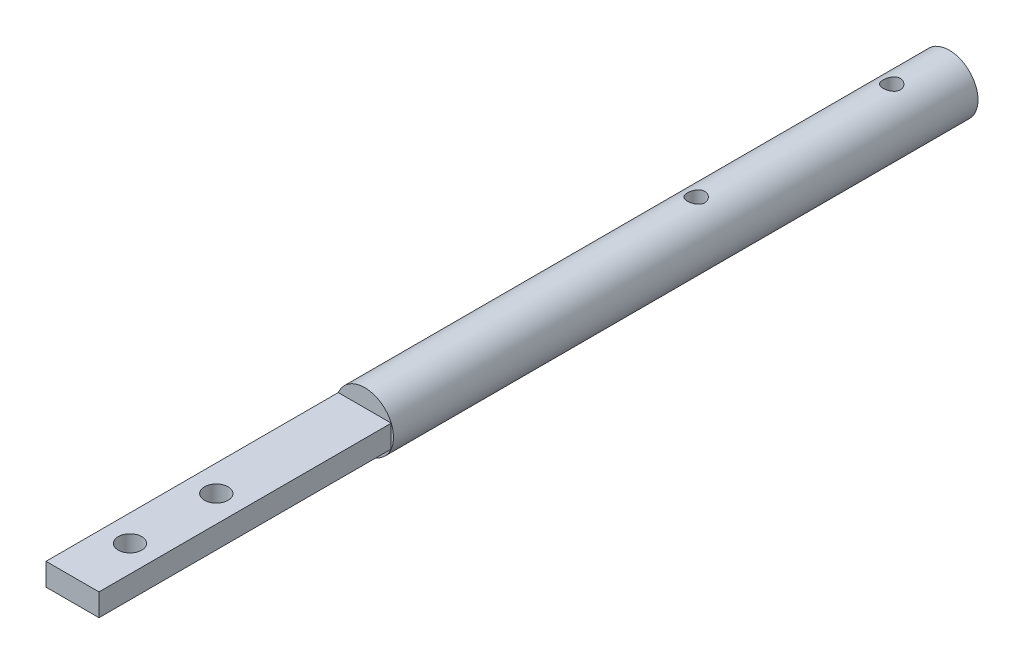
ISO-10303-21;
HEADER;
FILE_DESCRIPTION(('STEP AP214'),'2;1');
FILE_NAME('part.step','',(''),(''),'','','');
FILE_SCHEMA(('AUTOMOTIVE_DESIGN { 1 0 10303 214 1 1 1 1 }'));
ENDSEC;
DATA;
#1=APPLICATION_CONTEXT('core data for automotive mechanical design processes');
#2=APPLICATION_PROTOCOL_DEFINITION('international standard','automotive_design',2000,#1);
#3=PRODUCT_CONTEXT('',#1,'mechanical');
#4=PRODUCT('Part','Part','',(#3));
#5=PRODUCT_RELATED_PRODUCT_CATEGORY('part','',(#4));
#6=PRODUCT_DEFINITION_FORMATION('','',#4);
#7=PRODUCT_DEFINITION_CONTEXT('part definition',#1,'design');
#8=PRODUCT_DEFINITION('design','',#6,#7);
#9=PRODUCT_DEFINITION_SHAPE('','',#8);
#10=(LENGTH_UNIT() NAMED_UNIT(*) SI_UNIT(.MILLI.,.METRE.));
#11=(NAMED_UNIT(*) PLANE_ANGLE_UNIT() SI_UNIT($,.RADIAN.));
#12=(NAMED_UNIT(*) SI_UNIT($,.STERADIAN.) SOLID_ANGLE_UNIT());
#13=UNCERTAINTY_MEASURE_WITH_UNIT(LENGTH_MEASURE(1.E-05),#10,'distance_accuracy_value','');
#14=(GEOMETRIC_REPRESENTATION_CONTEXT(3) GLOBAL_UNCERTAINTY_ASSIGNED_CONTEXT((#13)) GLOBAL_UNIT_ASSIGNED_CONTEXT((#10,
#11,#12)) REPRESENTATION_CONTEXT('',''));
#15=CARTESIAN_POINT('',(0.,0.,0.));
#16=DIRECTION('',(0.,0.,1.));
#17=DIRECTION('',(1.,0.,0.));
#18=AXIS2_PLACEMENT_3D('',#15,#16,#17);
#19=CARTESIAN_POINT('',(0.,0.,50.8));
#20=DIRECTION('',(0.,0.,1.));
#21=DIRECTION('',(1.,0.,0.));
#22=AXIS2_PLACEMENT_3D('',#19,#20,#21);
#23=PLANE('',#22);
#24=DIRECTION('',(0.,-1.,0.));
#25=VECTOR('',#24,1.);
#26=CARTESIAN_POINT('',(-2.30241812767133,-0.974099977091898,50.8));
#27=LINE('',#26,#25);
#28=CARTESIAN_POINT('',(-2.30241812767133,0.974099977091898,50.8));
#29=VERTEX_POINT('',#28);
#30=CARTESIAN_POINT('',(-2.30241812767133,-0.974099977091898,50.8));
#31=VERTEX_POINT('',#30);
#32=EDGE_CURVE('E58',#29,#31,#27,.T.);
#33=ORIENTED_EDGE('',*,*,#32,.F.);
#34=CARTESIAN_POINT('',(0.,0.,50.8));
#35=DIRECTION('',(0.,0.,1.));
#36=DIRECTION('',(1.,0.,0.));
#37=AXIS2_PLACEMENT_3D('',#34,#35,#36);
#38=CIRCLE('',#37,2.5);
#39=EDGE_CURVE('E113',#29,#31,#38,.T.);
#40=ORIENTED_EDGE('',*,*,#39,.T.);
#41=EDGE_LOOP('',(#33,#40));
#42=FACE_BOUND('',#41,.T.);
#43=ADVANCED_FACE('F33',(#42),#23,.T.);
#44=DIRECTION('',(-1.,0.,0.));
#45=VECTOR('',#44,1.);
#46=CARTESIAN_POINT('',(2.30241812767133,0.974099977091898,50.8));
#47=LINE('',#46,#45);
#48=CARTESIAN_POINT('',(2.30241812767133,0.974099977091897,50.8));
#49=VERTEX_POINT('',#48);
#50=EDGE_CURVE('E98',#49,#29,#47,.T.);
#51=ORIENTED_EDGE('',*,*,#50,.F.);
#52=EDGE_CURVE('E110',#49,#29,#38,.T.);
#53=ORIENTED_EDGE('',*,*,#52,.T.);
#54=EDGE_LOOP('',(#51,#53));
#55=FACE_BOUND('',#54,.T.);
#56=ADVANCED_FACE('F164',(#55),#23,.T.);
#57=DIRECTION('',(0.,1.,0.));
#58=VECTOR('',#57,1.);
#59=CARTESIAN_POINT('',(2.30241812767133,-0.974099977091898,50.8));
#60=LINE('',#59,#58);
#61=CARTESIAN_POINT('',(2.30241812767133,-0.974099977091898,50.8));
#62=VERTEX_POINT('',#61);
#63=EDGE_CURVE('E178',#62,#49,#60,.T.);
#64=ORIENTED_EDGE('',*,*,#63,.F.);
#65=EDGE_CURVE('E104',#62,#49,#38,.T.);
#66=ORIENTED_EDGE('',*,*,#65,.T.);
#67=EDGE_LOOP('',(#64,#66));
#68=FACE_BOUND('',#67,.T.);
#69=ADVANCED_FACE('F157',(#68),#23,.T.);
#70=CARTESIAN_POINT('',(0.,0.,50.8));
#71=DIRECTION('',(0.,0.,-1.));
#72=DIRECTION('',(-1.,0.,0.));
#73=AXIS2_PLACEMENT_3D('',#70,#71,#72);
#74=CYLINDRICAL_SURFACE('',#73,2.5);
#75=CARTESIAN_POINT('',(0.,-2.5,22.75));
#76=CARTESIAN_POINT('',(0.0411443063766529,-2.49999964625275,22.7499995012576));
#77=CARTESIAN_POINT('',(0.082293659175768,-2.49897457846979,22.746603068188));
#78=CARTESIAN_POINT('',(0.163394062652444,-2.49498552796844,22.733139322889));
#79=CARTESIAN_POINT('',(0.203344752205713,-2.49202096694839,22.7230700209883));
#80=CARTESIAN_POINT('',(0.280866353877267,-2.48447776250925,22.6966269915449));
#81=CARTESIAN_POINT('',(0.318440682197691,-2.47990150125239,22.6802625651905));
#82=CARTESIAN_POINT('',(0.390312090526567,-2.46961054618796,22.6417319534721));
#83=CARTESIAN_POINT('',(0.424608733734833,-2.46389570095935,22.6195649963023));
#84=CARTESIAN_POINT('',(0.489935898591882,-2.45175368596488,22.5693879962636));
#85=CARTESIAN_POINT('',(0.520859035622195,-2.445311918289,22.5412416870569));
#86=CARTESIAN_POINT('',(0.577624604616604,-2.43252917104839,22.4801953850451));
#87=CARTESIAN_POINT('',(0.603466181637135,-2.42618820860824,22.447294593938));
#88=CARTESIAN_POINT('',(0.649900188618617,-2.41417056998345,22.3767646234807));
#89=CARTESIAN_POINT('',(0.670361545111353,-2.4085120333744,22.3390457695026));
#90=CARTESIAN_POINT('',(0.704606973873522,-2.39871810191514,22.2605053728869));
#91=CARTESIAN_POINT('',(0.718392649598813,-2.39458234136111,22.2196845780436));
#92=CARTESIAN_POINT('',(0.738508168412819,-2.38845435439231,22.1373048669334));
#93=CARTESIAN_POINT('',(0.745035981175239,-2.38640534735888,22.0957986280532));
#94=CARTESIAN_POINT('',(0.7510686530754,-2.38451394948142,22.0122334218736));
#95=CARTESIAN_POINT('',(0.750575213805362,-2.38467102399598,21.9701745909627));
#96=CARTESIAN_POINT('',(0.742734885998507,-2.38712372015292,21.8883080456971));
#97=CARTESIAN_POINT('',(0.735636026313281,-2.38934194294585,21.8484738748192));
#98=CARTESIAN_POINT('',(0.715187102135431,-2.39554178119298,21.7705901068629));
#99=CARTESIAN_POINT('',(0.701836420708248,-2.3995235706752,21.7325406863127));
#100=CARTESIAN_POINT('',(0.66908013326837,-2.40886366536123,21.6586998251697));
#101=CARTESIAN_POINT('',(0.649594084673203,-2.4142400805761,21.6229464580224));
#102=CARTESIAN_POINT('',(0.605176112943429,-2.42575493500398,21.5551339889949));
#103=CARTESIAN_POINT('',(0.580242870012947,-2.43189355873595,21.5230757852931));
#104=CARTESIAN_POINT('',(0.524406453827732,-2.44455505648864,21.462156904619));
#105=CARTESIAN_POINT('',(0.493297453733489,-2.45108327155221,21.4334856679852));
#106=CARTESIAN_POINT('',(0.426631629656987,-2.46356122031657,21.3817230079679));
#107=CARTESIAN_POINT('',(0.391074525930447,-2.46951091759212,21.3586319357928));
#108=CARTESIAN_POINT('',(0.316177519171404,-2.48021580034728,21.3185700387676));
#109=CARTESIAN_POINT('',(0.276813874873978,-2.48496271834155,21.3016412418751));
#110=CARTESIAN_POINT('',(0.195622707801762,-2.49266760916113,21.2747002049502));
#111=CARTESIAN_POINT('',(0.153795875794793,-2.495626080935,21.2646860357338));
#112=CARTESIAN_POINT('',(0.0704761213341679,-2.49934182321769,21.2521739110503));
#113=CARTESIAN_POINT('',(0.0290250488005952,-2.50017425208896,21.2494192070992));
#114=CARTESIAN_POINT('',(-0.0537498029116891,-2.49976461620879,21.250784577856));
#115=CARTESIAN_POINT('',(-0.095073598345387,-2.49852282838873,21.2549037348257));
#116=CARTESIAN_POINT('',(-0.175451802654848,-2.49415348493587,21.2696923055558));
#117=CARTESIAN_POINT('',(-0.214536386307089,-2.49106914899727,21.2802116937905));
#118=CARTESIAN_POINT('',(-0.290377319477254,-2.48337173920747,21.3073216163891));
#119=CARTESIAN_POINT('',(-0.32713338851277,-2.47875848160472,21.3239128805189));
#120=CARTESIAN_POINT('',(-0.398218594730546,-2.46834827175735,21.3631265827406));
#121=CARTESIAN_POINT('',(-0.432471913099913,-2.4625264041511,21.3858796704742));
#122=CARTESIAN_POINT('',(-0.496761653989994,-2.45036734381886,21.4366123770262));
#123=CARTESIAN_POINT('',(-0.526797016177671,-2.44403002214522,21.4645933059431));
#124=CARTESIAN_POINT('',(-0.58292872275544,-2.43126585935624,21.5261936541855));
#125=CARTESIAN_POINT('',(-0.608842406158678,-2.42484412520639,21.5599809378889));
#126=CARTESIAN_POINT('',(-0.654644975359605,-2.41288257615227,21.6315639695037));
#127=CARTESIAN_POINT('',(-0.674534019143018,-2.40734273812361,21.6693596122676));
#128=CARTESIAN_POINT('',(-0.707586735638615,-2.39783594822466,21.7477662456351));
#129=CARTESIAN_POINT('',(-0.72078173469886,-2.39386168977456,21.7883630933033));
#130=CARTESIAN_POINT('',(-0.740108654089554,-2.38795797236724,21.8713439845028));
#131=CARTESIAN_POINT('',(-0.74624299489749,-2.38602781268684,21.9137274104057));
#132=CARTESIAN_POINT('',(-0.751109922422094,-2.38449986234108,21.997180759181));
#133=CARTESIAN_POINT('',(-0.750140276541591,-2.38480823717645,22.0382318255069));
#134=CARTESIAN_POINT('',(-0.741537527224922,-2.38749700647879,22.1195570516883));
#135=CARTESIAN_POINT('',(-0.733904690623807,-2.3898773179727,22.1598312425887));
#136=CARTESIAN_POINT('',(-0.712384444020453,-2.39637881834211,22.2379726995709));
#137=CARTESIAN_POINT('',(-0.69857587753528,-2.40047802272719,22.2758636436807));
#138=CARTESIAN_POINT('',(-0.665157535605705,-2.40995139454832,22.348821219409));
#139=CARTESIAN_POINT('',(-0.645546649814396,-2.41532580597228,22.3838873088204));
#140=CARTESIAN_POINT('',(-0.600243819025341,-2.42698838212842,22.4515815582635));
#141=CARTESIAN_POINT('',(-0.574356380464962,-2.43330270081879,22.4840743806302));
#142=CARTESIAN_POINT('',(-0.51758717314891,-2.44600660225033,22.5443512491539));
#143=CARTESIAN_POINT('',(-0.486704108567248,-2.45239620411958,22.5721340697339));
#144=CARTESIAN_POINT('',(-0.419732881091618,-2.46475468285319,22.6230117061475));
#145=CARTESIAN_POINT('',(-0.383518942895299,-2.47070579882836,22.6459457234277));
#146=CARTESIAN_POINT('',(-0.307570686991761,-2.48130340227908,22.685367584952));
#147=CARTESIAN_POINT('',(-0.267838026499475,-2.48595049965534,22.7018584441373));
#148=CARTESIAN_POINT('',(-0.190378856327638,-2.4930108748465,22.7264476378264));
#149=CARTESIAN_POINT('',(-0.152893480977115,-2.49561013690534,22.7352558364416));
#150=CARTESIAN_POINT('',(-0.0769400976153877,-2.49910472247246,22.7470317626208));
#151=CARTESIAN_POINT('',(-0.0384722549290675,-2.5000003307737,22.7500004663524));
#152=CARTESIAN_POINT('',(0.,-2.5,22.75));
#153=B_SPLINE_CURVE_WITH_KNOTS('',3,(#75,#76,#77,#78,#79,#80,#81,#82,#83,#84,#85,#86,#87,#88,
#89,#90,#91,#92,#93,#94,#95,#96,#97,#98,#99,#100,#101,#102,#103,#104,#105,#106,#107,#108,#109,
#110,#111,#112,#113,#114,#115,#116,#117,#118,#119,#120,#121,#122,#123,#124,#125,#126,#127,#128,
#129,#130,#131,#132,#133,#134,#135,#136,#137,#138,#139,#140,#141,#142,#143,#144,#145,#146,#147,
#148,#149,#150,#151,#152),.UNSPECIFIED.,.T.,.F.,(4,2,2,2,2,2,2,2,2,2,2,2,2,2,2,2,2,2,2,2,2,2,2,
2,2,2,2,2,2,2,2,2,2,2,2,2,2,2,4),(0.,0.123291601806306,0.246619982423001,0.369766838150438,
0.492930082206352,0.619278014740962,0.745647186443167,0.874857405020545,1.00403657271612,
1.12959844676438,1.25512989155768,1.37613008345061,1.49714221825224,1.61981213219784,
1.74251180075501,1.87033552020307,1.99816728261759,2.12685523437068,2.25550726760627,
2.37954404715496,2.50356426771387,2.62478373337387,2.74601777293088,2.87005652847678,
2.99412640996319,3.12270200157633,3.25127422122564,3.37923907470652,3.50716004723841,
3.62975077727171,3.752336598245,3.8734002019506,3.99448698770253,4.11998462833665,
4.24551487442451,4.37471498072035,4.50385455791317,4.61915845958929,4.73444308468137),.UNSPECIFIED.);
#154=CARTESIAN_POINT('',(0.,-2.5,22.75));
#155=VERTEX_POINT('',#154);
#156=EDGE_CURVE('E11',#155,#155,#153,.T.);
#157=ORIENTED_EDGE('',*,*,#156,.T.);
#158=EDGE_LOOP('',(#157));
#159=FACE_BOUND('',#158,.T.);
#160=CARTESIAN_POINT('',(0.,2.5,22.75));
#161=CARTESIAN_POINT('',(-0.0411443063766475,2.49999964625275,22.7499995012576));
#162=CARTESIAN_POINT('',(-0.0822936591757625,2.49897457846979,22.746603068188));
#163=CARTESIAN_POINT('',(-0.163394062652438,2.49498552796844,22.733139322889));
#164=CARTESIAN_POINT('',(-0.203344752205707,2.49202096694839,22.7230700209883));
#165=CARTESIAN_POINT('',(-0.280866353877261,2.48447776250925,22.6966269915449));
#166=CARTESIAN_POINT('',(-0.318440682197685,2.47990150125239,22.6802625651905));
#167=CARTESIAN_POINT('',(-0.390312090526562,2.46961054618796,22.6417319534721));
#168=CARTESIAN_POINT('',(-0.424608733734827,2.46389570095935,22.6195649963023));
#169=CARTESIAN_POINT('',(-0.489935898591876,2.45175368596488,22.5693879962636));
#170=CARTESIAN_POINT('',(-0.520859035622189,2.445311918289,22.5412416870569));
#171=CARTESIAN_POINT('',(-0.577624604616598,2.43252917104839,22.4801953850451));
#172=CARTESIAN_POINT('',(-0.60346618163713,2.42618820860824,22.447294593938));
#173=CARTESIAN_POINT('',(-0.649900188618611,2.41417056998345,22.3767646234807));
#174=CARTESIAN_POINT('',(-0.670361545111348,2.4085120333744,22.3390457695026));
#175=CARTESIAN_POINT('',(-0.704606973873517,2.39871810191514,22.2605053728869));
#176=CARTESIAN_POINT('',(-0.718392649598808,2.39458234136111,22.2196845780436));
#177=CARTESIAN_POINT('',(-0.738508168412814,2.38845435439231,22.1373048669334));
#178=CARTESIAN_POINT('',(-0.745035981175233,2.38640534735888,22.0957986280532));
#179=CARTESIAN_POINT('',(-0.751068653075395,2.38451394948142,22.0122334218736));
#180=CARTESIAN_POINT('',(-0.750575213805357,2.38467102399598,21.9701745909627));
#181=CARTESIAN_POINT('',(-0.742734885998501,2.38712372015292,21.8883080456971));
#182=CARTESIAN_POINT('',(-0.735636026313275,2.38934194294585,21.8484738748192));
#183=CARTESIAN_POINT('',(-0.715187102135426,2.39554178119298,21.7705901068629));
#184=CARTESIAN_POINT('',(-0.701836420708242,2.3995235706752,21.7325406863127));
#185=CARTESIAN_POINT('',(-0.669080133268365,2.40886366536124,21.6586998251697));
#186=CARTESIAN_POINT('',(-0.649594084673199,2.4142400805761,21.6229464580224));
#187=CARTESIAN_POINT('',(-0.605176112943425,2.42575493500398,21.5551339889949));
#188=CARTESIAN_POINT('',(-0.580242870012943,2.43189355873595,21.5230757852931));
#189=CARTESIAN_POINT('',(-0.524406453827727,2.44455505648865,21.462156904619));
#190=CARTESIAN_POINT('',(-0.493297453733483,2.45108327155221,21.4334856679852));
#191=CARTESIAN_POINT('',(-0.426631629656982,2.46356122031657,21.3817230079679));
#192=CARTESIAN_POINT('',(-0.391074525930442,2.46951091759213,21.3586319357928));
#193=CARTESIAN_POINT('',(-0.316177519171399,2.48021580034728,21.3185700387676));
#194=CARTESIAN_POINT('',(-0.276813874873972,2.48496271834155,21.3016412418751));
#195=CARTESIAN_POINT('',(-0.195622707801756,2.49266760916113,21.2747002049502));
#196=CARTESIAN_POINT('',(-0.153795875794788,2.495626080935,21.2646860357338));
#197=CARTESIAN_POINT('',(-0.0704761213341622,2.49934182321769,21.2521739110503));
#198=CARTESIAN_POINT('',(-0.0290250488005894,2.50017425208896,21.2494192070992));
#199=CARTESIAN_POINT('',(0.0537498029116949,2.49976461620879,21.250784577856));
#200=CARTESIAN_POINT('',(0.0950735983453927,2.49852282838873,21.2549037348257));
#201=CARTESIAN_POINT('',(0.175451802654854,2.49415348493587,21.2696923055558));
#202=CARTESIAN_POINT('',(0.214536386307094,2.49106914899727,21.2802116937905));
#203=CARTESIAN_POINT('',(0.290377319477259,2.48337173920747,21.3073216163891));
#204=CARTESIAN_POINT('',(0.327133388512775,2.47875848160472,21.3239128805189));
#205=CARTESIAN_POINT('',(0.398218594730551,2.46834827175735,21.3631265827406));
#206=CARTESIAN_POINT('',(0.432471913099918,2.4625264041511,21.3858796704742));
#207=CARTESIAN_POINT('',(0.496761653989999,2.45036734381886,21.4366123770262));
#208=CARTESIAN_POINT('',(0.526797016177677,2.44403002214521,21.4645933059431));
#209=CARTESIAN_POINT('',(0.582928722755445,2.43126585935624,21.5261936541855));
#210=CARTESIAN_POINT('',(0.608842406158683,2.42484412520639,21.5599809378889));
#211=CARTESIAN_POINT('',(0.65464497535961,2.41288257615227,21.6315639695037));
#212=CARTESIAN_POINT('',(0.674534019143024,2.40734273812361,21.6693596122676));
#213=CARTESIAN_POINT('',(0.70758673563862,2.39783594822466,21.7477662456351));
#214=CARTESIAN_POINT('',(0.720781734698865,2.39386168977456,21.7883630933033));
#215=CARTESIAN_POINT('',(0.740108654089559,2.38795797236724,21.8713439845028));
#216=CARTESIAN_POINT('',(0.746242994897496,2.38602781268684,21.9137274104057));
#217=CARTESIAN_POINT('',(0.751109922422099,2.38449986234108,21.997180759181));
#218=CARTESIAN_POINT('',(0.750140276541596,2.38480823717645,22.0382318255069));
#219=CARTESIAN_POINT('',(0.741537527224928,2.38749700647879,22.1195570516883));
#220=CARTESIAN_POINT('',(0.733904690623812,2.3898773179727,22.1598312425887));
#221=CARTESIAN_POINT('',(0.712384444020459,2.39637881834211,22.2379726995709));
#222=CARTESIAN_POINT('',(0.698575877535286,2.40047802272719,22.2758636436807));
#223=CARTESIAN_POINT('',(0.665157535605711,2.40995139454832,22.348821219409));
#224=CARTESIAN_POINT('',(0.645546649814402,2.41532580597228,22.3838873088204));
#225=CARTESIAN_POINT('',(0.600243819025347,2.42698838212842,22.4515815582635));
#226=CARTESIAN_POINT('',(0.574356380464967,2.43330270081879,22.4840743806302));
#227=CARTESIAN_POINT('',(0.517587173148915,2.44600660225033,22.5443512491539));
#228=CARTESIAN_POINT('',(0.486704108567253,2.45239620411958,22.5721340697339));
#229=CARTESIAN_POINT('',(0.419732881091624,2.46475468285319,22.6230117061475));
#230=CARTESIAN_POINT('',(0.383518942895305,2.47070579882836,22.6459457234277));
#231=CARTESIAN_POINT('',(0.307570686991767,2.48130340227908,22.685367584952));
#232=CARTESIAN_POINT('',(0.26783802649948,2.48595049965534,22.7018584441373));
#233=CARTESIAN_POINT('',(0.190378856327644,2.4930108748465,22.7264476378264));
#234=CARTESIAN_POINT('',(0.15289348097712,2.49561013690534,22.7352558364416));
#235=CARTESIAN_POINT('',(0.0769400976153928,2.49910472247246,22.7470317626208));
#236=CARTESIAN_POINT('',(0.0384722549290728,2.5000003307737,22.7500004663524));
#237=CARTESIAN_POINT('',(0.,2.5,22.75));
#238=B_SPLINE_CURVE_WITH_KNOTS('',3,(#160,#161,#162,#163,#164,#165,#166,#167,#168,#169,#170,
#171,#172,#173,#174,#175,#176,#177,#178,#179,#180,#181,#182,#183,#184,#185,#186,#187,#188,#189,
#190,#191,#192,#193,#194,#195,#196,#197,#198,#199,#200,#201,#202,#203,#204,#205,#206,#207,#208,
#209,#210,#211,#212,#213,#214,#215,#216,#217,#218,#219,#220,#221,#222,#223,#224,#225,#226,#227,
#228,#229,#230,#231,#232,#233,#234,#235,#236,#237),.UNSPECIFIED.,.T.,.F.,(4,2,2,2,2,2,2,2,2,2,2,
2,2,2,2,2,2,2,2,2,2,2,2,2,2,2,2,2,2,2,2,2,2,2,2,2,2,2,4),(0.,0.123291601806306,0.246619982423,
0.369766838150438,0.492930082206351,0.619278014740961,0.745647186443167,0.874857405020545,
1.00403657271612,1.12959844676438,1.25512989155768,1.37613008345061,1.49714221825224,
1.61981213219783,1.74251180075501,1.87033552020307,1.99816728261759,2.12685523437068,
2.25550726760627,2.37954404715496,2.50356426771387,2.62478373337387,2.74601777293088,
2.87005652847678,2.99412640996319,3.12270200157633,3.25127422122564,3.37923907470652,
3.50716004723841,3.62975077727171,3.752336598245,3.8734002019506,3.99448698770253,
4.11998462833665,4.24551487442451,4.37471498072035,4.50385455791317,4.61915845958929,
4.73444308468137),.UNSPECIFIED.);
#239=CARTESIAN_POINT('',(0.,2.5,22.75));
#240=VERTEX_POINT('',#239);
#241=EDGE_CURVE('E45',#240,#240,#238,.T.);
#242=ORIENTED_EDGE('',*,*,#241,.T.);
#243=EDGE_LOOP('',(#242));
#244=FACE_BOUND('',#243,.T.);
#245=CARTESIAN_POINT('',(0.,-2.5,5.75));
#246=CARTESIAN_POINT('',(0.0411443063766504,-2.49999964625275,5.74999950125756));
#247=CARTESIAN_POINT('',(0.0822936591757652,-2.49897457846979,5.74660306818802));
#248=CARTESIAN_POINT('',(0.163394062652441,-2.49498552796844,5.73313932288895));
#249=CARTESIAN_POINT('',(0.20334475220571,-2.49202096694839,5.72307002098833));
#250=CARTESIAN_POINT('',(0.280866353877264,-2.48447776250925,5.69662699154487));
#251=CARTESIAN_POINT('',(0.318440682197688,-2.47990150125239,5.68026256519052));
#252=CARTESIAN_POINT('',(0.390312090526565,-2.46961054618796,5.64173195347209));
#253=CARTESIAN_POINT('',(0.42460873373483,-2.46389570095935,5.61956499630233));
#254=CARTESIAN_POINT('',(0.489935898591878,-2.45175368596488,5.56938799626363));
#255=CARTESIAN_POINT('',(0.52085903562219,-2.445311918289,5.5412416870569));
#256=CARTESIAN_POINT('',(0.577624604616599,-2.43252917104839,5.48019538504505));
#257=CARTESIAN_POINT('',(0.603466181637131,-2.42618820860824,5.44729459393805));
#258=CARTESIAN_POINT('',(0.649900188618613,-2.41417056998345,5.37676462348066));
#259=CARTESIAN_POINT('',(0.67036154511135,-2.4085120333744,5.33904576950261));
#260=CARTESIAN_POINT('',(0.704606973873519,-2.39871810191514,5.26050537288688));
#261=CARTESIAN_POINT('',(0.71839264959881,-2.39458234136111,5.21968457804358));
#262=CARTESIAN_POINT('',(0.738508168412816,-2.38845435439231,5.13730486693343));
#263=CARTESIAN_POINT('',(0.745035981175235,-2.38640534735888,5.09579862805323));
#264=CARTESIAN_POINT('',(0.751068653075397,-2.38451394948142,5.01223342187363));
#265=CARTESIAN_POINT('',(0.750575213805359,-2.38467102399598,4.97017459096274));
#266=CARTESIAN_POINT('',(0.742734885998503,-2.38712372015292,4.88830804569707));
#267=CARTESIAN_POINT('',(0.735636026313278,-2.38934194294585,4.84847387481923));
#268=CARTESIAN_POINT('',(0.715187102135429,-2.39554178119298,4.77059010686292));
#269=CARTESIAN_POINT('',(0.701836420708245,-2.3995235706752,4.73254068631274));
#270=CARTESIAN_POINT('',(0.669080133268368,-2.40886366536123,4.65869982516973));
#271=CARTESIAN_POINT('',(0.649594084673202,-2.4142400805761,4.6229464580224));
#272=CARTESIAN_POINT('',(0.605176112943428,-2.42575493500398,4.55513398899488));
#273=CARTESIAN_POINT('',(0.580242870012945,-2.43189355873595,4.52307578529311));
#274=CARTESIAN_POINT('',(0.524406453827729,-2.44455505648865,4.462156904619));
#275=CARTESIAN_POINT('',(0.493297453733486,-2.45108327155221,4.43348566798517));
#276=CARTESIAN_POINT('',(0.426631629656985,-2.46356122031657,4.38172300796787));
#277=CARTESIAN_POINT('',(0.391074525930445,-2.46951091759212,4.35863193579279));
#278=CARTESIAN_POINT('',(0.316177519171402,-2.48021580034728,4.31857003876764));
#279=CARTESIAN_POINT('',(0.276813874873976,-2.48496271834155,4.30164124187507));
#280=CARTESIAN_POINT('',(0.195622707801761,-2.49266760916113,4.27470020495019));
#281=CARTESIAN_POINT('',(0.153795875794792,-2.495626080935,4.26468603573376));
#282=CARTESIAN_POINT('',(0.0704761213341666,-2.49934182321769,4.2521739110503));
#283=CARTESIAN_POINT('',(0.029025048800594,-2.50017425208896,4.2494192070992));
#284=CARTESIAN_POINT('',(-0.0537498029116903,-2.49976461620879,4.25078457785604));
#285=CARTESIAN_POINT('',(-0.0950735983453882,-2.49852282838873,4.25490373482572));
#286=CARTESIAN_POINT('',(-0.175451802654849,-2.49415348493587,4.26969230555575));
#287=CARTESIAN_POINT('',(-0.214536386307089,-2.49106914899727,4.28021169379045));
#288=CARTESIAN_POINT('',(-0.290377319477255,-2.48337173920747,4.30732161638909));
#289=CARTESIAN_POINT('',(-0.327133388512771,-2.47875848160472,4.32391288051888));
#290=CARTESIAN_POINT('',(-0.398218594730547,-2.46834827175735,4.36312658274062));
#291=CARTESIAN_POINT('',(-0.432471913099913,-2.4625264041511,4.3858796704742));
#292=CARTESIAN_POINT('',(-0.496761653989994,-2.45036734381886,4.4366123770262));
#293=CARTESIAN_POINT('',(-0.526797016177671,-2.44403002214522,4.46459330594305));
#294=CARTESIAN_POINT('',(-0.58292872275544,-2.43126585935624,4.52619365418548));
#295=CARTESIAN_POINT('',(-0.608842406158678,-2.42484412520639,4.55998093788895));
#296=CARTESIAN_POINT('',(-0.654644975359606,-2.41288257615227,4.63156396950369));
#297=CARTESIAN_POINT('',(-0.67453401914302,-2.40734273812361,4.66935961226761));
#298=CARTESIAN_POINT('',(-0.707586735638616,-2.39783594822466,4.74776624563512));
#299=CARTESIAN_POINT('',(-0.720781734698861,-2.39386168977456,4.7883630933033));
#300=CARTESIAN_POINT('',(-0.740108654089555,-2.38795797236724,4.87134398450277));
#301=CARTESIAN_POINT('',(-0.746242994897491,-2.38602781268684,4.91372741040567));
#302=CARTESIAN_POINT('',(-0.751109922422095,-2.38449986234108,4.99718075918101));
#303=CARTESIAN_POINT('',(-0.750140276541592,-2.38480823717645,5.03823182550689));
#304=CARTESIAN_POINT('',(-0.741537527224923,-2.38749700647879,5.1195570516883));
#305=CARTESIAN_POINT('',(-0.733904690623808,-2.3898773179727,5.15983124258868));
#306=CARTESIAN_POINT('',(-0.712384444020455,-2.39637881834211,5.23797269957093));
#307=CARTESIAN_POINT('',(-0.698575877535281,-2.40047802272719,5.27586364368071));
#308=CARTESIAN_POINT('',(-0.665157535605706,-2.40995139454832,5.348821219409));
#309=CARTESIAN_POINT('',(-0.645546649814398,-2.41532580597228,5.38388730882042));
#310=CARTESIAN_POINT('',(-0.600243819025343,-2.42698838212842,5.45158155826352));
#311=CARTESIAN_POINT('',(-0.574356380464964,-2.43330270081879,5.4840743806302));
#312=CARTESIAN_POINT('',(-0.517587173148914,-2.44600660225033,5.54435124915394));
#313=CARTESIAN_POINT('',(-0.486704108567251,-2.45239620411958,5.57213406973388));
#314=CARTESIAN_POINT('',(-0.419732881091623,-2.46475468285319,5.62301170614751));
#315=CARTESIAN_POINT('',(-0.383518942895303,-2.47070579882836,5.64594572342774));
#316=CARTESIAN_POINT('',(-0.307570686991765,-2.48130340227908,5.68536758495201));
#317=CARTESIAN_POINT('',(-0.267838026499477,-2.48595049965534,5.70185844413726));
#318=CARTESIAN_POINT('',(-0.19037885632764,-2.4930108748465,5.72644763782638));
#319=CARTESIAN_POINT('',(-0.152893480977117,-2.49561013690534,5.73525583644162));
#320=CARTESIAN_POINT('',(-0.0769400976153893,-2.49910472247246,5.74703176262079));
#321=CARTESIAN_POINT('',(-0.0384722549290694,-2.5000003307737,5.75000046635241));
#322=CARTESIAN_POINT('',(0.,-2.5,5.75));
#323=B_SPLINE_CURVE_WITH_KNOTS('',3,(#245,#246,#247,#248,#249,#250,#251,#252,#253,#254,#255,
#256,#257,#258,#259,#260,#261,#262,#263,#264,#265,#266,#267,#268,#269,#270,#271,#272,#273,#274,
#275,#276,#277,#278,#279,#280,#281,#282,#283,#284,#285,#286,#287,#288,#289,#290,#291,#292,#293,
#294,#295,#296,#297,#298,#299,#300,#301,#302,#303,#304,#305,#306,#307,#308,#309,#310,#311,#312,
#313,#314,#315,#316,#317,#318,#319,#320,#321,#322),.UNSPECIFIED.,.T.,.F.,(4,2,2,2,2,2,2,2,2,2,2,
2,2,2,2,2,2,2,2,2,2,2,2,2,2,2,2,2,2,2,2,2,2,2,2,2,2,2,4),(0.,0.123291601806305,0.246619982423,
0.369766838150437,0.492930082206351,0.619278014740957,0.745647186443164,0.874857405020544,
1.00403657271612,1.12959844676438,1.25512989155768,1.37613008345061,1.49714221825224,
1.61981213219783,1.74251180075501,1.87033552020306,1.99816728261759,2.12685523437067,
2.25550726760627,2.37954404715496,2.50356426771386,2.62478373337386,2.74601777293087,
2.87005652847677,2.99412640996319,3.12270200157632,3.25127422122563,3.37923907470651,
3.5071600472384,3.6297507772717,3.75233659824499,3.87340020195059,3.99448698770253,
4.11998462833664,4.2455148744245,4.37471498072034,4.50385455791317,4.61915845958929,
4.73444308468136),.UNSPECIFIED.);
#324=CARTESIAN_POINT('',(0.,-2.5,5.75));
#325=VERTEX_POINT('',#324);
#326=EDGE_CURVE('E120',#325,#325,#323,.T.);
#327=ORIENTED_EDGE('',*,*,#326,.T.);
#328=EDGE_LOOP('',(#327));
#329=FACE_BOUND('',#328,.T.);
#330=CARTESIAN_POINT('',(0.,2.5,5.75));
#331=CARTESIAN_POINT('',(-0.0411443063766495,2.49999964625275,5.74999950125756));
#332=CARTESIAN_POINT('',(-0.0822936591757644,2.49897457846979,5.74660306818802));
#333=CARTESIAN_POINT('',(-0.16339406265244,2.49498552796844,5.73313932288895));
#334=CARTESIAN_POINT('',(-0.203344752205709,2.49202096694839,5.72307002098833));
#335=CARTESIAN_POINT('',(-0.280866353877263,2.48447776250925,5.69662699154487));
#336=CARTESIAN_POINT('',(-0.318440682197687,2.47990150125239,5.68026256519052));
#337=CARTESIAN_POINT('',(-0.390312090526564,2.46961054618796,5.64173195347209));
#338=CARTESIAN_POINT('',(-0.424608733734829,2.46389570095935,5.61956499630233));
#339=CARTESIAN_POINT('',(-0.489935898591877,2.45175368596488,5.56938799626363));
#340=CARTESIAN_POINT('',(-0.520859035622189,2.445311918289,5.5412416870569));
#341=CARTESIAN_POINT('',(-0.577624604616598,2.43252917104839,5.48019538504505));
#342=CARTESIAN_POINT('',(-0.60346618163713,2.42618820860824,5.44729459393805));
#343=CARTESIAN_POINT('',(-0.649900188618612,2.41417056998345,5.37676462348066));
#344=CARTESIAN_POINT('',(-0.670361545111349,2.4085120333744,5.33904576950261));
#345=CARTESIAN_POINT('',(-0.704606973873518,2.39871810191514,5.26050537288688));
#346=CARTESIAN_POINT('',(-0.718392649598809,2.39458234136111,5.21968457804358));
#347=CARTESIAN_POINT('',(-0.738508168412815,2.38845435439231,5.13730486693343));
#348=CARTESIAN_POINT('',(-0.745035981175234,2.38640534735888,5.09579862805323));
#349=CARTESIAN_POINT('',(-0.751068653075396,2.38451394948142,5.01223342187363));
#350=CARTESIAN_POINT('',(-0.750575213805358,2.38467102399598,4.97017459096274));
#351=CARTESIAN_POINT('',(-0.742734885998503,2.38712372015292,4.88830804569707));
#352=CARTESIAN_POINT('',(-0.735636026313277,2.38934194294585,4.84847387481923));
#353=CARTESIAN_POINT('',(-0.715187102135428,2.39554178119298,4.77059010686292));
#354=CARTESIAN_POINT('',(-0.701836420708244,2.3995235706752,4.73254068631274));
#355=CARTESIAN_POINT('',(-0.669080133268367,2.40886366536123,4.65869982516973));
#356=CARTESIAN_POINT('',(-0.649594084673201,2.4142400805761,4.6229464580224));
#357=CARTESIAN_POINT('',(-0.605176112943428,2.42575493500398,4.55513398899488));
#358=CARTESIAN_POINT('',(-0.580242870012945,2.43189355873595,4.52307578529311));
#359=CARTESIAN_POINT('',(-0.524406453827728,2.44455505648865,4.462156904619));
#360=CARTESIAN_POINT('',(-0.493297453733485,2.45108327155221,4.43348566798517));
#361=CARTESIAN_POINT('',(-0.426631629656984,2.46356122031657,4.38172300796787));
#362=CARTESIAN_POINT('',(-0.391074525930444,2.46951091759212,4.35863193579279));
#363=CARTESIAN_POINT('',(-0.316177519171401,2.48021580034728,4.31857003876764));
#364=CARTESIAN_POINT('',(-0.276813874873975,2.48496271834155,4.30164124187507));
#365=CARTESIAN_POINT('',(-0.19562270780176,2.49266760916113,4.27470020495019));
#366=CARTESIAN_POINT('',(-0.153795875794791,2.495626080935,4.26468603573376));
#367=CARTESIAN_POINT('',(-0.0704761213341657,2.49934182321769,4.2521739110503));
#368=CARTESIAN_POINT('',(-0.0290250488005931,2.50017425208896,4.2494192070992));
#369=CARTESIAN_POINT('',(0.0537498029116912,2.49976461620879,4.25078457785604));
#370=CARTESIAN_POINT('',(0.095073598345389,2.49852282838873,4.25490373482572));
#371=CARTESIAN_POINT('',(0.17545180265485,2.49415348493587,4.26969230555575));
#372=CARTESIAN_POINT('',(0.21453638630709,2.49106914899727,4.28021169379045));
#373=CARTESIAN_POINT('',(0.290377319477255,2.48337173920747,4.30732161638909));
#374=CARTESIAN_POINT('',(0.327133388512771,2.47875848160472,4.32391288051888));
#375=CARTESIAN_POINT('',(0.398218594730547,2.46834827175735,4.36312658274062));
#376=CARTESIAN_POINT('',(0.432471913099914,2.4625264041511,4.3858796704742));
#377=CARTESIAN_POINT('',(0.496761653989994,2.45036734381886,4.4366123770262));
#378=CARTESIAN_POINT('',(0.526797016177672,2.44403002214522,4.46459330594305));
#379=CARTESIAN_POINT('',(0.582928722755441,2.43126585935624,4.52619365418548));
#380=CARTESIAN_POINT('',(0.608842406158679,2.42484412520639,4.55998093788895));
#381=CARTESIAN_POINT('',(0.654644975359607,2.41288257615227,4.63156396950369));
#382=CARTESIAN_POINT('',(0.674534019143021,2.40734273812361,4.66935961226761));
#383=CARTESIAN_POINT('',(0.707586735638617,2.39783594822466,4.74776624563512));
#384=CARTESIAN_POINT('',(0.720781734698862,2.39386168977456,4.7883630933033));
#385=CARTESIAN_POINT('',(0.740108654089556,2.38795797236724,4.87134398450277));
#386=CARTESIAN_POINT('',(0.746242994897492,2.38602781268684,4.91372741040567));
#387=CARTESIAN_POINT('',(0.751109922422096,2.38449986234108,4.99718075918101));
#388=CARTESIAN_POINT('',(0.750140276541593,2.38480823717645,5.03823182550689));
#389=CARTESIAN_POINT('',(0.741537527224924,2.38749700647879,5.1195570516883));
#390=CARTESIAN_POINT('',(0.733904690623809,2.3898773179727,5.15983124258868));
#391=CARTESIAN_POINT('',(0.712384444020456,2.39637881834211,5.23797269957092));
#392=CARTESIAN_POINT('',(0.698575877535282,2.40047802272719,5.27586364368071));
#393=CARTESIAN_POINT('',(0.665157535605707,2.40995139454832,5.348821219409));
#394=CARTESIAN_POINT('',(0.645546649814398,2.41532580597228,5.38388730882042));
#395=CARTESIAN_POINT('',(0.600243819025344,2.42698838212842,5.45158155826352));
#396=CARTESIAN_POINT('',(0.574356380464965,2.43330270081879,5.4840743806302));
#397=CARTESIAN_POINT('',(0.517587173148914,2.44600660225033,5.54435124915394));
#398=CARTESIAN_POINT('',(0.486704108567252,2.45239620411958,5.57213406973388));
#399=CARTESIAN_POINT('',(0.419732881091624,2.46475468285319,5.62301170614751));
#400=CARTESIAN_POINT('',(0.383518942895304,2.47070579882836,5.64594572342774));
#401=CARTESIAN_POINT('',(0.307570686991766,2.48130340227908,5.68536758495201));
#402=CARTESIAN_POINT('',(0.267838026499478,2.48595049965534,5.70185844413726));
#403=CARTESIAN_POINT('',(0.190378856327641,2.4930108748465,5.72644763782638));
#404=CARTESIAN_POINT('',(0.152893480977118,2.49561013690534,5.73525583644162));
#405=CARTESIAN_POINT('',(0.0769400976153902,2.49910472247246,5.74703176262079));
#406=CARTESIAN_POINT('',(0.0384722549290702,2.5000003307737,5.75000046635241));
#407=CARTESIAN_POINT('',(0.,2.5,5.75));
#408=B_SPLINE_CURVE_WITH_KNOTS('',3,(#330,#331,#332,#333,#334,#335,#336,#337,#338,#339,#340,
#341,#342,#343,#344,#345,#346,#347,#348,#349,#350,#351,#352,#353,#354,#355,#356,#357,#358,#359,
#360,#361,#362,#363,#364,#365,#366,#367,#368,#369,#370,#371,#372,#373,#374,#375,#376,#377,#378,
#379,#380,#381,#382,#383,#384,#385,#386,#387,#388,#389,#390,#391,#392,#393,#394,#395,#396,#397,
#398,#399,#400,#401,#402,#403,#404,#405,#406,#407),.UNSPECIFIED.,.T.,.F.,(4,2,2,2,2,2,2,2,2,2,2,
2,2,2,2,2,2,2,2,2,2,2,2,2,2,2,2,2,2,2,2,2,2,2,2,2,2,2,4),(0.,0.123291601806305,0.246619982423,
0.369766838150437,0.492930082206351,0.619278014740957,0.745647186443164,0.874857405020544,
1.00403657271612,1.12959844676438,1.25512989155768,1.37613008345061,1.49714221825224,
1.61981213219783,1.74251180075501,1.87033552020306,1.99816728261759,2.12685523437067,
2.25550726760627,2.37954404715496,2.50356426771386,2.62478373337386,2.74601777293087,
2.87005652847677,2.99412640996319,3.12270200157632,3.25127422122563,3.37923907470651,
3.5071600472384,3.6297507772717,3.75233659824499,3.8734002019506,3.99448698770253,
4.11998462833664,4.2455148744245,4.37471498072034,4.50385455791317,4.61915845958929,
4.73444308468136),.UNSPECIFIED.);
#409=CARTESIAN_POINT('',(0.,2.5,5.75));
#410=VERTEX_POINT('',#409);
#411=EDGE_CURVE('E112',#410,#410,#408,.T.);
#412=ORIENTED_EDGE('',*,*,#411,.T.);
#413=EDGE_LOOP('',(#412));
#414=FACE_BOUND('',#413,.T.);
#415=ORIENTED_EDGE('',*,*,#52,.F.);
#416=ORIENTED_EDGE('',*,*,#65,.F.);
#417=EDGE_CURVE('E184',#31,#62,#38,.T.);
#418=ORIENTED_EDGE('',*,*,#417,.F.);
#419=ORIENTED_EDGE('',*,*,#39,.F.);
#420=EDGE_LOOP('',(#415,#416,#418,#419));
#421=FACE_BOUND('',#420,.T.);
#422=CARTESIAN_POINT('',(0.,0.,0.));
#423=DIRECTION('',(0.,0.,1.));
#424=DIRECTION('',(1.,0.,0.));
#425=AXIS2_PLACEMENT_3D('',#422,#423,#424);
#426=CIRCLE('',#425,2.5);
#427=CARTESIAN_POINT('',(2.5,0.,0.));
#428=VERTEX_POINT('',#427);
#429=EDGE_CURVE('E101',#428,#428,#426,.T.);
#430=ORIENTED_EDGE('',*,*,#429,.T.);
#431=EDGE_LOOP('',(#430));
#432=FACE_BOUND('',#431,.T.);
#433=ADVANCED_FACE('F35',(#159,#244,#329,#414,#421,#432),#74,.T.);
#434=DIRECTION('',(1.,0.,0.));
#435=VECTOR('',#434,1.);
#436=CARTESIAN_POINT('',(2.30241812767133,-0.974099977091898,50.8));
#437=LINE('',#436,#435);
#438=EDGE_CURVE('E51',#31,#62,#437,.T.);
#439=ORIENTED_EDGE('',*,*,#438,.F.);
#440=ORIENTED_EDGE('',*,*,#417,.T.);
#441=EDGE_LOOP('',(#439,#440));
#442=FACE_BOUND('',#441,.T.);
#443=ADVANCED_FACE('F155',(#442),#23,.T.);
#444=CARTESIAN_POINT('',(0.,0.,0.));
#445=DIRECTION('',(0.,0.,1.));
#446=DIRECTION('',(1.,0.,0.));
#447=AXIS2_PLACEMENT_3D('',#444,#445,#446);
#448=PLANE('',#447);
#449=ORIENTED_EDGE('',*,*,#429,.F.);
#450=EDGE_LOOP('',(#449));
#451=FACE_BOUND('',#450,.T.);
#452=ADVANCED_FACE('F154',(#451),#448,.F.);
#453=CARTESIAN_POINT('',(-2.30241812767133,-0.974099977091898,76.2));
#454=DIRECTION('',(1.,0.,0.));
#455=DIRECTION('',(0.,0.,-1.));
#456=AXIS2_PLACEMENT_3D('',#453,#454,#455);
#457=PLANE('',#456);
#458=ORIENTED_EDGE('',*,*,#32,.T.);
#459=DIRECTION('',(0.,0.,-1.));
#460=VECTOR('',#459,1.);
#461=CARTESIAN_POINT('',(-2.30241812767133,-0.974099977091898,76.2));
#462=LINE('',#461,#460);
#463=CARTESIAN_POINT('',(-2.30241812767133,-0.974099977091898,76.2));
#464=VERTEX_POINT('',#463);
#465=EDGE_CURVE('E83',#464,#31,#462,.T.);
#466=ORIENTED_EDGE('',*,*,#465,.F.);
#467=DIRECTION('',(0.,-1.,0.));
#468=VECTOR('',#467,1.);
#469=CARTESIAN_POINT('',(-2.30241812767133,-0.974099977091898,76.2));
#470=LINE('',#469,#468);
#471=CARTESIAN_POINT('',(-2.30241812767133,0.974099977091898,76.2));
#472=VERTEX_POINT('',#471);
#473=EDGE_CURVE('E89',#472,#464,#470,.T.);
#474=ORIENTED_EDGE('',*,*,#473,.F.);
#475=DIRECTION('',(0.,0.,-1.));
#476=VECTOR('',#475,1.);
#477=CARTESIAN_POINT('',(-2.30241812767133,0.974099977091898,76.2));
#478=LINE('',#477,#476);
#479=EDGE_CURVE('E188',#472,#29,#478,.T.);
#480=ORIENTED_EDGE('',*,*,#479,.T.);
#481=EDGE_LOOP('',(#458,#466,#474,#480));
#482=FACE_BOUND('',#481,.T.);
#483=ADVANCED_FACE('F100',(#482),#457,.F.);
#484=CARTESIAN_POINT('',(2.30241812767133,-0.974099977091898,76.2));
#485=DIRECTION('',(0.,1.,0.));
#486=DIRECTION('',(0.,0.,1.));
#487=AXIS2_PLACEMENT_3D('',#484,#485,#486);
#488=PLANE('',#487);
#489=CARTESIAN_POINT('',(0.,-0.974099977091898,71.2));
#490=DIRECTION('',(0.,1.,0.));
#491=DIRECTION('',(0.,0.,1.));
#492=AXIS2_PLACEMENT_3D('',#489,#490,#491);
#493=CIRCLE('',#492,1.02271797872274);
#494=CARTESIAN_POINT('',(0.,-0.974099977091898,72.2227179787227));
#495=VERTEX_POINT('',#494);
#496=EDGE_CURVE('E201',#495,#495,#493,.T.);
#497=ORIENTED_EDGE('',*,*,#496,.T.);
#498=EDGE_LOOP('',(#497));
#499=FACE_BOUND('',#498,.T.);
#500=CARTESIAN_POINT('',(0.,-0.974099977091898,63.7));
#501=DIRECTION('',(0.,1.,0.));
#502=DIRECTION('',(0.,0.,1.));
#503=AXIS2_PLACEMENT_3D('',#500,#501,#502);
#504=CIRCLE('',#503,1.02271797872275);
#505=CARTESIAN_POINT('',(0.,-0.974099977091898,64.7227179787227));
#506=VERTEX_POINT('',#505);
#507=EDGE_CURVE('E193',#506,#506,#504,.T.);
#508=ORIENTED_EDGE('',*,*,#507,.T.);
#509=EDGE_LOOP('',(#508));
#510=FACE_BOUND('',#509,.T.);
#511=ORIENTED_EDGE('',*,*,#438,.T.);
#512=DIRECTION('',(0.,0.,-1.));
#513=VECTOR('',#512,1.);
#514=CARTESIAN_POINT('',(2.30241812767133,-0.974099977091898,76.2));
#515=LINE('',#514,#513);
#516=CARTESIAN_POINT('',(2.30241812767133,-0.974099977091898,76.2));
#517=VERTEX_POINT('',#516);
#518=EDGE_CURVE('E85',#517,#62,#515,.T.);
#519=ORIENTED_EDGE('',*,*,#518,.F.);
#520=DIRECTION('',(1.,0.,0.));
#521=VECTOR('',#520,1.);
#522=CARTESIAN_POINT('',(2.30241812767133,-0.974099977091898,76.2));
#523=LINE('',#522,#521);
#524=EDGE_CURVE('E79',#464,#517,#523,.T.);
#525=ORIENTED_EDGE('',*,*,#524,.F.);
#526=ORIENTED_EDGE('',*,*,#465,.T.);
#527=EDGE_LOOP('',(#511,#519,#525,#526));
#528=FACE_BOUND('',#527,.T.);
#529=ADVANCED_FACE('F81',(#499,#510,#528),#488,.F.);
#530=CARTESIAN_POINT('',(2.30241812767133,-0.974099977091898,76.2));
#531=DIRECTION('',(-1.,0.,0.));
#532=DIRECTION('',(0.,0.,1.));
#533=AXIS2_PLACEMENT_3D('',#530,#531,#532);
#534=PLANE('',#533);
#535=ORIENTED_EDGE('',*,*,#63,.T.);
#536=DIRECTION('',(0.,0.,-1.));
#537=VECTOR('',#536,1.);
#538=CARTESIAN_POINT('',(2.30241812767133,0.974099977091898,76.2));
#539=LINE('',#538,#537);
#540=CARTESIAN_POINT('',(2.30241812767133,0.974099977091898,76.2));
#541=VERTEX_POINT('',#540);
#542=EDGE_CURVE('E106',#541,#49,#539,.T.);
#543=ORIENTED_EDGE('',*,*,#542,.F.);
#544=DIRECTION('',(0.,1.,0.));
#545=VECTOR('',#544,1.);
#546=CARTESIAN_POINT('',(2.30241812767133,-0.974099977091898,76.2));
#547=LINE('',#546,#545);
#548=EDGE_CURVE('E88',#517,#541,#547,.T.);
#549=ORIENTED_EDGE('',*,*,#548,.F.);
#550=ORIENTED_EDGE('',*,*,#518,.T.);
#551=EDGE_LOOP('',(#535,#543,#549,#550));
#552=FACE_BOUND('',#551,.T.);
#553=ADVANCED_FACE('F144',(#552),#534,.F.);
#554=CARTESIAN_POINT('',(2.30241812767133,0.974099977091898,76.2));
#555=DIRECTION('',(0.,-1.,0.));
#556=DIRECTION('',(0.,0.,-1.));
#557=AXIS2_PLACEMENT_3D('',#554,#555,#556);
#558=PLANE('',#557);
#559=CARTESIAN_POINT('',(0.,0.974099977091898,71.2));
#560=DIRECTION('',(0.,1.,0.));
#561=DIRECTION('',(0.,0.,1.));
#562=AXIS2_PLACEMENT_3D('',#559,#560,#561);
#563=CIRCLE('',#562,1.02271797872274);
#564=CARTESIAN_POINT('',(0.,0.974099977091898,72.2227179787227));
#565=VERTEX_POINT('',#564);
#566=EDGE_CURVE('E204',#565,#565,#563,.T.);
#567=ORIENTED_EDGE('',*,*,#566,.F.);
#568=EDGE_LOOP('',(#567));
#569=FACE_BOUND('',#568,.T.);
#570=CARTESIAN_POINT('',(0.,0.974099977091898,63.7));
#571=DIRECTION('',(0.,1.,0.));
#572=DIRECTION('',(0.,0.,1.));
#573=AXIS2_PLACEMENT_3D('',#570,#571,#572);
#574=CIRCLE('',#573,1.02271797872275);
#575=CARTESIAN_POINT('',(0.,0.974099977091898,64.7227179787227));
#576=VERTEX_POINT('',#575);
#577=EDGE_CURVE('E198',#576,#576,#574,.T.);
#578=ORIENTED_EDGE('',*,*,#577,.F.);
#579=EDGE_LOOP('',(#578));
#580=FACE_BOUND('',#579,.T.);
#581=ORIENTED_EDGE('',*,*,#50,.T.);
#582=ORIENTED_EDGE('',*,*,#479,.F.);
#583=DIRECTION('',(-1.,0.,0.));
#584=VECTOR('',#583,1.);
#585=CARTESIAN_POINT('',(2.30241812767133,0.974099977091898,76.2));
#586=LINE('',#585,#584);
#587=EDGE_CURVE('E94',#541,#472,#586,.T.);
#588=ORIENTED_EDGE('',*,*,#587,.F.);
#589=ORIENTED_EDGE('',*,*,#542,.T.);
#590=EDGE_LOOP('',(#581,#582,#588,#589));
#591=FACE_BOUND('',#590,.T.);
#592=ADVANCED_FACE('F141',(#569,#580,#591),#558,.F.);
#593=CARTESIAN_POINT('',(0.,0.,76.2));
#594=DIRECTION('',(0.,0.,1.));
#595=DIRECTION('',(1.,0.,0.));
#596=AXIS2_PLACEMENT_3D('',#593,#594,#595);
#597=PLANE('',#596);
#598=ORIENTED_EDGE('',*,*,#473,.T.);
#599=ORIENTED_EDGE('',*,*,#524,.T.);
#600=ORIENTED_EDGE('',*,*,#548,.T.);
#601=ORIENTED_EDGE('',*,*,#587,.T.);
#602=EDGE_LOOP('',(#598,#599,#600,#601));
#603=FACE_BOUND('',#602,.T.);
#604=ADVANCED_FACE('F92',(#603),#597,.T.);
#605=CARTESIAN_POINT('',(0.,-2.5,63.7));
#606=DIRECTION('',(0.,1.,0.));
#607=DIRECTION('',(0.,0.,1.));
#608=AXIS2_PLACEMENT_3D('',#605,#606,#607);
#609=CYLINDRICAL_SURFACE('',#608,1.02271797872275);
#610=ORIENTED_EDGE('',*,*,#577,.T.);
#611=EDGE_LOOP('',(#610));
#612=FACE_BOUND('',#611,.T.);
#613=ORIENTED_EDGE('',*,*,#507,.F.);
#614=EDGE_LOOP('',(#613));
#615=FACE_BOUND('',#614,.T.);
#616=ADVANCED_FACE('F134',(#612,#615),#609,.F.);
#617=CARTESIAN_POINT('',(0.,-2.5,71.2));
#618=DIRECTION('',(0.,1.,0.));
#619=DIRECTION('',(0.,0.,1.));
#620=AXIS2_PLACEMENT_3D('',#617,#618,#619);
#621=CYLINDRICAL_SURFACE('',#620,1.02271797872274);
#622=ORIENTED_EDGE('',*,*,#566,.T.);
#623=EDGE_LOOP('',(#622));
#624=FACE_BOUND('',#623,.T.);
#625=ORIENTED_EDGE('',*,*,#496,.F.);
#626=EDGE_LOOP('',(#625));
#627=FACE_BOUND('',#626,.T.);
#628=ADVANCED_FACE('F128',(#624,#627),#621,.F.);
#629=CARTESIAN_POINT('',(0.,-2.5,5.));
#630=DIRECTION('',(0.,1.,0.));
#631=DIRECTION('',(0.,0.,1.));
#632=AXIS2_PLACEMENT_3D('',#629,#630,#631);
#633=CYLINDRICAL_SURFACE('',#632,0.75);
#634=ORIENTED_EDGE('',*,*,#411,.F.);
#635=EDGE_LOOP('',(#634));
#636=FACE_BOUND('',#635,.T.);
#637=ORIENTED_EDGE('',*,*,#326,.F.);
#638=EDGE_LOOP('',(#637));
#639=FACE_BOUND('',#638,.T.);
#640=ADVANCED_FACE('F123',(#636,#639),#633,.F.);
#641=CARTESIAN_POINT('',(0.,-2.5,22.));
#642=DIRECTION('',(0.,1.,0.));
#643=DIRECTION('',(0.,0.,1.));
#644=AXIS2_PLACEMENT_3D('',#641,#642,#643);
#645=CYLINDRICAL_SURFACE('',#644,0.750000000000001);
#646=ORIENTED_EDGE('',*,*,#241,.F.);
#647=EDGE_LOOP('',(#646));
#648=FACE_BOUND('',#647,.T.);
#649=ORIENTED_EDGE('',*,*,#156,.F.);
#650=EDGE_LOOP('',(#649));
#651=FACE_BOUND('',#650,.T.);
#652=ADVANCED_FACE('F127',(#648,#651),#645,.F.);
#653=CLOSED_SHELL('',(#43,#56,#69,#433,#443,#452,#483,#529,#553,#592,#604,#616,#628,#640,#652));
#654=MANIFOLD_SOLID_BREP('B2',#653);
#655=ADVANCED_BREP_SHAPE_REPRESENTATION('',(#18,#654),#14);
#656=SHAPE_DEFINITION_REPRESENTATION(#9,#655);
ENDSEC;
END-ISO-10303-21;
